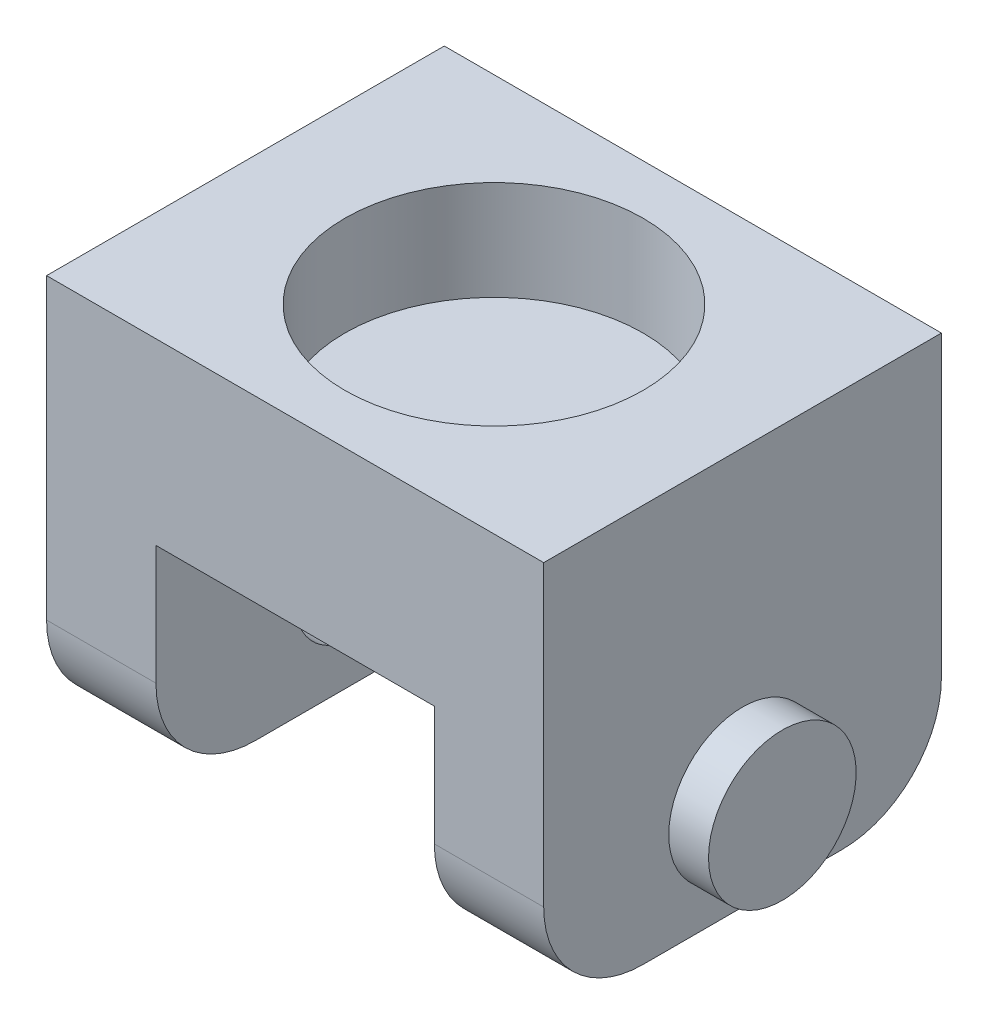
ISO-10303-21;
HEADER;
FILE_DESCRIPTION(('STEP AP214'),'2;1');
FILE_NAME('part.step','',(''),(''),'','','');
FILE_SCHEMA(('AUTOMOTIVE_DESIGN { 1 0 10303 214 1 1 1 1 }'));
ENDSEC;
DATA;
#1=APPLICATION_CONTEXT('core data for automotive mechanical design processes');
#2=APPLICATION_PROTOCOL_DEFINITION('international standard','automotive_design',2000,#1);
#3=PRODUCT_CONTEXT('',#1,'mechanical');
#4=PRODUCT('Part','Part','',(#3));
#5=PRODUCT_RELATED_PRODUCT_CATEGORY('part','',(#4));
#6=PRODUCT_DEFINITION_FORMATION('','',#4);
#7=PRODUCT_DEFINITION_CONTEXT('part definition',#1,'design');
#8=PRODUCT_DEFINITION('design','',#6,#7);
#9=PRODUCT_DEFINITION_SHAPE('','',#8);
#10=(LENGTH_UNIT() NAMED_UNIT(*) SI_UNIT(.MILLI.,.METRE.));
#11=(NAMED_UNIT(*) PLANE_ANGLE_UNIT() SI_UNIT($,.RADIAN.));
#12=(NAMED_UNIT(*) SI_UNIT($,.STERADIAN.) SOLID_ANGLE_UNIT());
#13=UNCERTAINTY_MEASURE_WITH_UNIT(LENGTH_MEASURE(1.E-05),#10,'distance_accuracy_value','');
#14=(GEOMETRIC_REPRESENTATION_CONTEXT(3) GLOBAL_UNCERTAINTY_ASSIGNED_CONTEXT((#13)) GLOBAL_UNIT_ASSIGNED_CONTEXT((#10,
#11,#12)) REPRESENTATION_CONTEXT('',''));
#15=CARTESIAN_POINT('',(0.,0.,0.));
#16=DIRECTION('',(0.,0.,1.));
#17=DIRECTION('',(1.,0.,0.));
#18=AXIS2_PLACEMENT_3D('',#15,#16,#17);
#19=CARTESIAN_POINT('',(0.,0.,0.));
#20=DIRECTION('',(0.,1.,0.));
#21=DIRECTION('',(0.,0.,1.));
#22=AXIS2_PLACEMENT_3D('',#19,#20,#21);
#23=PLANE('',#22);
#24=DIRECTION('',(0.,0.,-1.));
#25=VECTOR('',#24,1.);
#26=CARTESIAN_POINT('',(6.99999999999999,0.,0.));
#27=LINE('',#26,#25);
#28=CARTESIAN_POINT('',(6.99999999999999,0.,5.));
#29=VERTEX_POINT('',#28);
#30=CARTESIAN_POINT('',(6.99999999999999,0.,-5.));
#31=VERTEX_POINT('',#30);
#32=EDGE_CURVE('E198',#29,#31,#27,.T.);
#33=ORIENTED_EDGE('',*,*,#32,.T.);
#34=DIRECTION('',(-1.,0.,0.));
#35=VECTOR('',#34,1.);
#36=CARTESIAN_POINT('',(0.,0.,-5.));
#37=LINE('',#36,#35);
#38=CARTESIAN_POINT('',(12.5,0.,-5.));
#39=VERTEX_POINT('',#38);
#40=EDGE_CURVE('E215',#31,#39,#37,.F.);
#41=ORIENTED_EDGE('',*,*,#40,.T.);
#42=DIRECTION('',(0.,0.,-1.));
#43=VECTOR('',#42,1.);
#44=CARTESIAN_POINT('',(12.5,0.,-10.));
#45=LINE('',#44,#43);
#46=CARTESIAN_POINT('',(12.5,0.,5.));
#47=VERTEX_POINT('',#46);
#48=EDGE_CURVE('E168',#47,#39,#45,.T.);
#49=ORIENTED_EDGE('',*,*,#48,.F.);
#50=DIRECTION('',(1.,0.,0.));
#51=VECTOR('',#50,1.);
#52=CARTESIAN_POINT('',(0.,0.,5.));
#53=LINE('',#52,#51);
#54=EDGE_CURVE('E213',#47,#29,#53,.F.);
#55=ORIENTED_EDGE('',*,*,#54,.T.);
#56=EDGE_LOOP('',(#33,#41,#49,#55));
#57=FACE_BOUND('',#56,.T.);
#58=ADVANCED_FACE('F38',(#57),#23,.F.);
#59=CARTESIAN_POINT('',(12.5,20.,-10.));
#60=DIRECTION('',(-1.,0.,0.));
#61=DIRECTION('',(0.,0.,1.));
#62=AXIS2_PLACEMENT_3D('',#59,#60,#61);
#63=PLANE('',#62);
#64=CARTESIAN_POINT('',(12.5,5.,0.));
#65=DIRECTION('',(-1.,0.,0.));
#66=DIRECTION('',(0.,0.,1.));
#67=AXIS2_PLACEMENT_3D('',#64,#65,#66);
#68=CIRCLE('',#67,3.71229475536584);
#69=CARTESIAN_POINT('',(12.5,5.,3.71229475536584));
#70=VERTEX_POINT('',#69);
#71=EDGE_CURVE('E456',#70,#70,#68,.T.);
#72=ORIENTED_EDGE('',*,*,#71,.T.);
#73=EDGE_LOOP('',(#72));
#74=FACE_BOUND('',#73,.T.);
#75=ORIENTED_EDGE('',*,*,#48,.T.);
#76=CARTESIAN_POINT('',(12.5,5.,-5.));
#77=DIRECTION('',(-1.,0.,0.));
#78=DIRECTION('',(0.,0.,1.));
#79=AXIS2_PLACEMENT_3D('',#76,#77,#78);
#80=CIRCLE('',#79,5.);
#81=CARTESIAN_POINT('',(12.5,5.,-10.));
#82=VERTEX_POINT('',#81);
#83=EDGE_CURVE('E219',#39,#82,#80,.F.);
#84=ORIENTED_EDGE('',*,*,#83,.T.);
#85=DIRECTION('',(0.,-1.,0.));
#86=VECTOR('',#85,1.);
#87=CARTESIAN_POINT('',(12.5,20.,-10.));
#88=LINE('',#87,#86);
#89=CARTESIAN_POINT('',(12.5,20.,-10.));
#90=VERTEX_POINT('',#89);
#91=EDGE_CURVE('E194',#90,#82,#88,.T.);
#92=ORIENTED_EDGE('',*,*,#91,.F.);
#93=DIRECTION('',(0.,0.,-1.));
#94=VECTOR('',#93,1.);
#95=CARTESIAN_POINT('',(12.5,20.,-10.));
#96=LINE('',#95,#94);
#97=CARTESIAN_POINT('',(12.5,20.,10.));
#98=VERTEX_POINT('',#97);
#99=EDGE_CURVE('E171',#98,#90,#96,.T.);
#100=ORIENTED_EDGE('',*,*,#99,.F.);
#101=DIRECTION('',(0.,-1.,0.));
#102=VECTOR('',#101,1.);
#103=CARTESIAN_POINT('',(12.5,20.,10.));
#104=LINE('',#103,#102);
#105=CARTESIAN_POINT('',(12.5,5.,10.));
#106=VERTEX_POINT('',#105);
#107=EDGE_CURVE('E181',#98,#106,#104,.T.);
#108=ORIENTED_EDGE('',*,*,#107,.T.);
#109=CARTESIAN_POINT('',(12.5,5.,5.));
#110=DIRECTION('',(-1.,0.,0.));
#111=DIRECTION('',(0.,0.,1.));
#112=AXIS2_PLACEMENT_3D('',#109,#110,#111);
#113=CIRCLE('',#112,5.);
#114=EDGE_CURVE('E217',#106,#47,#113,.F.);
#115=ORIENTED_EDGE('',*,*,#114,.T.);
#116=EDGE_LOOP('',(#75,#84,#92,#100,#108,#115));
#117=FACE_BOUND('',#116,.T.);
#118=ADVANCED_FACE('F271',(#74,#117),#63,.F.);
#119=CARTESIAN_POINT('',(-12.5,20.,-10.));
#120=DIRECTION('',(0.,0.,1.));
#121=DIRECTION('',(1.,0.,0.));
#122=AXIS2_PLACEMENT_3D('',#119,#120,#121);
#123=PLANE('',#122);
#124=ORIENTED_EDGE('',*,*,#91,.T.);
#125=DIRECTION('',(-1.,0.,0.));
#126=VECTOR('',#125,1.);
#127=CARTESIAN_POINT('',(-12.5,5.,-10.));
#128=LINE('',#127,#126);
#129=CARTESIAN_POINT('',(6.99999999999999,5.,-10.));
#130=VERTEX_POINT('',#129);
#131=EDGE_CURVE('E137',#82,#130,#128,.T.);
#132=ORIENTED_EDGE('',*,*,#131,.T.);
#133=DIRECTION('',(0.,1.,0.));
#134=VECTOR('',#133,1.);
#135=CARTESIAN_POINT('',(6.99999999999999,11.,-10.));
#136=LINE('',#135,#134);
#137=CARTESIAN_POINT('',(6.99999999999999,11.,-10.));
#138=VERTEX_POINT('',#137);
#139=EDGE_CURVE('E129',#130,#138,#136,.T.);
#140=ORIENTED_EDGE('',*,*,#139,.T.);
#141=DIRECTION('',(-1.,0.,0.));
#142=VECTOR('',#141,1.);
#143=CARTESIAN_POINT('',(-7.00000000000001,11.,-10.));
#144=LINE('',#143,#142);
#145=CARTESIAN_POINT('',(-7.00000000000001,11.,-10.));
#146=VERTEX_POINT('',#145);
#147=EDGE_CURVE('E135',#138,#146,#144,.T.);
#148=ORIENTED_EDGE('',*,*,#147,.T.);
#149=DIRECTION('',(0.,-1.,0.));
#150=VECTOR('',#149,1.);
#151=CARTESIAN_POINT('',(-7.00000000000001,11.,-10.));
#152=LINE('',#151,#150);
#153=CARTESIAN_POINT('',(-7.00000000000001,5.,-10.));
#154=VERTEX_POINT('',#153);
#155=EDGE_CURVE('E150',#146,#154,#152,.T.);
#156=ORIENTED_EDGE('',*,*,#155,.T.);
#157=DIRECTION('',(-1.,0.,0.));
#158=VECTOR('',#157,1.);
#159=CARTESIAN_POINT('',(-12.5,5.,-10.));
#160=LINE('',#159,#158);
#161=CARTESIAN_POINT('',(-12.5,5.,-10.));
#162=VERTEX_POINT('',#161);
#163=EDGE_CURVE('E201',#154,#162,#160,.T.);
#164=ORIENTED_EDGE('',*,*,#163,.T.);
#165=DIRECTION('',(0.,-1.,0.));
#166=VECTOR('',#165,1.);
#167=CARTESIAN_POINT('',(-12.5,20.,-10.));
#168=LINE('',#167,#166);
#169=CARTESIAN_POINT('',(-12.5,20.,-10.));
#170=VERTEX_POINT('',#169);
#171=EDGE_CURVE('E191',#170,#162,#168,.T.);
#172=ORIENTED_EDGE('',*,*,#171,.F.);
#173=DIRECTION('',(-1.,0.,0.));
#174=VECTOR('',#173,1.);
#175=CARTESIAN_POINT('',(-12.5,20.,-10.));
#176=LINE('',#175,#174);
#177=EDGE_CURVE('E174',#90,#170,#176,.T.);
#178=ORIENTED_EDGE('',*,*,#177,.F.);
#179=EDGE_LOOP('',(#124,#132,#140,#148,#156,#164,#172,#178));
#180=FACE_BOUND('',#179,.T.);
#181=ADVANCED_FACE('F132',(#180),#123,.F.);
#182=CARTESIAN_POINT('',(-12.5,20.,-10.));
#183=DIRECTION('',(1.,0.,0.));
#184=DIRECTION('',(0.,0.,-1.));
#185=AXIS2_PLACEMENT_3D('',#182,#183,#184);
#186=PLANE('',#185);
#187=CARTESIAN_POINT('',(-12.5,5.,0.));
#188=DIRECTION('',(1.,0.,0.));
#189=DIRECTION('',(0.,0.,-1.));
#190=AXIS2_PLACEMENT_3D('',#187,#188,#189);
#191=CIRCLE('',#190,3.71229475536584);
#192=CARTESIAN_POINT('',(-12.5,5.,-3.71229475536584));
#193=VERTEX_POINT('',#192);
#194=EDGE_CURVE('E11',#193,#193,#191,.F.);
#195=ORIENTED_EDGE('',*,*,#194,.F.);
#196=EDGE_LOOP('',(#195));
#197=FACE_BOUND('',#196,.T.);
#198=ORIENTED_EDGE('',*,*,#171,.T.);
#199=CARTESIAN_POINT('',(-12.5,5.,-5.));
#200=DIRECTION('',(1.,0.,0.));
#201=DIRECTION('',(0.,0.,-1.));
#202=AXIS2_PLACEMENT_3D('',#199,#200,#201);
#203=CIRCLE('',#202,5.);
#204=CARTESIAN_POINT('',(-12.5,0.,-5.));
#205=VERTEX_POINT('',#204);
#206=EDGE_CURVE('E229',#162,#205,#203,.F.);
#207=ORIENTED_EDGE('',*,*,#206,.T.);
#208=DIRECTION('',(0.,0.,1.));
#209=VECTOR('',#208,1.);
#210=CARTESIAN_POINT('',(-12.5,0.,-10.));
#211=LINE('',#210,#209);
#212=CARTESIAN_POINT('',(-12.5,0.,5.));
#213=VERTEX_POINT('',#212);
#214=EDGE_CURVE('E175',#205,#213,#211,.T.);
#215=ORIENTED_EDGE('',*,*,#214,.T.);
#216=CARTESIAN_POINT('',(-12.5,5.,5.));
#217=DIRECTION('',(1.,0.,0.));
#218=DIRECTION('',(0.,0.,-1.));
#219=AXIS2_PLACEMENT_3D('',#216,#217,#218);
#220=CIRCLE('',#219,5.);
#221=CARTESIAN_POINT('',(-12.5,5.,10.));
#222=VERTEX_POINT('',#221);
#223=EDGE_CURVE('E227',#213,#222,#220,.F.);
#224=ORIENTED_EDGE('',*,*,#223,.T.);
#225=DIRECTION('',(0.,-1.,0.));
#226=VECTOR('',#225,1.);
#227=CARTESIAN_POINT('',(-12.5,20.,10.));
#228=LINE('',#227,#226);
#229=CARTESIAN_POINT('',(-12.5,20.,10.));
#230=VERTEX_POINT('',#229);
#231=EDGE_CURVE('E188',#230,#222,#228,.T.);
#232=ORIENTED_EDGE('',*,*,#231,.F.);
#233=DIRECTION('',(0.,0.,1.));
#234=VECTOR('',#233,1.);
#235=CARTESIAN_POINT('',(-12.5,20.,-10.));
#236=LINE('',#235,#234);
#237=EDGE_CURVE('E177',#170,#230,#236,.T.);
#238=ORIENTED_EDGE('',*,*,#237,.F.);
#239=EDGE_LOOP('',(#198,#207,#215,#224,#232,#238));
#240=FACE_BOUND('',#239,.T.);
#241=ADVANCED_FACE('F241',(#197,#240),#186,.F.);
#242=CARTESIAN_POINT('',(-12.5,20.,10.));
#243=DIRECTION('',(0.,0.,-1.));
#244=DIRECTION('',(-1.,0.,0.));
#245=AXIS2_PLACEMENT_3D('',#242,#243,#244);
#246=PLANE('',#245);
#247=DIRECTION('',(0.,1.,0.));
#248=VECTOR('',#247,1.);
#249=CARTESIAN_POINT('',(6.99999999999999,11.,10.));
#250=LINE('',#249,#248);
#251=CARTESIAN_POINT('',(6.99999999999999,5.,10.));
#252=VERTEX_POINT('',#251);
#253=CARTESIAN_POINT('',(6.99999999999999,11.,10.));
#254=VERTEX_POINT('',#253);
#255=EDGE_CURVE('E145',#252,#254,#250,.T.);
#256=ORIENTED_EDGE('',*,*,#255,.F.);
#257=DIRECTION('',(1.,0.,0.));
#258=VECTOR('',#257,1.);
#259=CARTESIAN_POINT('',(-12.5,5.,10.));
#260=LINE('',#259,#258);
#261=EDGE_CURVE('E224',#252,#106,#260,.T.);
#262=ORIENTED_EDGE('',*,*,#261,.T.);
#263=ORIENTED_EDGE('',*,*,#107,.F.);
#264=DIRECTION('',(1.,0.,0.));
#265=VECTOR('',#264,1.);
#266=CARTESIAN_POINT('',(-12.5,20.,10.));
#267=LINE('',#266,#265);
#268=EDGE_CURVE('E179',#230,#98,#267,.T.);
#269=ORIENTED_EDGE('',*,*,#268,.F.);
#270=ORIENTED_EDGE('',*,*,#231,.T.);
#271=DIRECTION('',(1.,0.,0.));
#272=VECTOR('',#271,1.);
#273=CARTESIAN_POINT('',(-12.5,5.,10.));
#274=LINE('',#273,#272);
#275=CARTESIAN_POINT('',(-7.00000000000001,5.,10.));
#276=VERTEX_POINT('',#275);
#277=EDGE_CURVE('E221',#222,#276,#274,.T.);
#278=ORIENTED_EDGE('',*,*,#277,.T.);
#279=DIRECTION('',(0.,-1.,0.));
#280=VECTOR('',#279,1.);
#281=CARTESIAN_POINT('',(-7.00000000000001,11.,10.));
#282=LINE('',#281,#280);
#283=CARTESIAN_POINT('',(-7.00000000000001,11.,10.));
#284=VERTEX_POINT('',#283);
#285=EDGE_CURVE('E139',#284,#276,#282,.T.);
#286=ORIENTED_EDGE('',*,*,#285,.F.);
#287=DIRECTION('',(-1.,0.,0.));
#288=VECTOR('',#287,1.);
#289=CARTESIAN_POINT('',(-7.00000000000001,11.,10.));
#290=LINE('',#289,#288);
#291=EDGE_CURVE('E159',#254,#284,#290,.T.);
#292=ORIENTED_EDGE('',*,*,#291,.F.);
#293=EDGE_LOOP('',(#256,#262,#263,#269,#270,#278,#286,#292));
#294=FACE_BOUND('',#293,.T.);
#295=ADVANCED_FACE('F251',(#294),#246,.F.);
#296=CARTESIAN_POINT('',(0.,20.,0.));
#297=DIRECTION('',(0.,1.,0.));
#298=DIRECTION('',(0.,0.,1.));
#299=AXIS2_PLACEMENT_3D('',#296,#297,#298);
#300=PLANE('',#299);
#301=CARTESIAN_POINT('',(0.,20.,0.));
#302=DIRECTION('',(0.,1.,0.));
#303=DIRECTION('',(0.,0.,1.));
#304=AXIS2_PLACEMENT_3D('',#301,#302,#303);
#305=CIRCLE('',#304,7.5);
#306=CARTESIAN_POINT('',(0.,20.,7.5));
#307=VERTEX_POINT('',#306);
#308=EDGE_CURVE('E163',#307,#307,#305,.T.);
#309=ORIENTED_EDGE('',*,*,#308,.F.);
#310=EDGE_LOOP('',(#309));
#311=FACE_BOUND('',#310,.T.);
#312=ORIENTED_EDGE('',*,*,#99,.T.);
#313=ORIENTED_EDGE('',*,*,#177,.T.);
#314=ORIENTED_EDGE('',*,*,#237,.T.);
#315=ORIENTED_EDGE('',*,*,#268,.T.);
#316=EDGE_LOOP('',(#312,#313,#314,#315));
#317=FACE_BOUND('',#316,.T.);
#318=ADVANCED_FACE('F256',(#311,#317),#300,.T.);
#319=ORIENTED_EDGE('',*,*,#214,.F.);
#320=DIRECTION('',(-1.,0.,0.));
#321=VECTOR('',#320,1.);
#322=CARTESIAN_POINT('',(0.,0.,-5.));
#323=LINE('',#322,#321);
#324=CARTESIAN_POINT('',(-7.00000000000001,0.,-5.));
#325=VERTEX_POINT('',#324);
#326=EDGE_CURVE('E60',#205,#325,#323,.F.);
#327=ORIENTED_EDGE('',*,*,#326,.T.);
#328=DIRECTION('',(0.,0.,1.));
#329=VECTOR('',#328,1.);
#330=CARTESIAN_POINT('',(-7.00000000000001,0.,0.));
#331=LINE('',#330,#329);
#332=CARTESIAN_POINT('',(-7.00000000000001,0.,5.));
#333=VERTEX_POINT('',#332);
#334=EDGE_CURVE('E196',#325,#333,#331,.T.);
#335=ORIENTED_EDGE('',*,*,#334,.T.);
#336=DIRECTION('',(1.,0.,0.));
#337=VECTOR('',#336,1.);
#338=CARTESIAN_POINT('',(0.,0.,5.));
#339=LINE('',#338,#337);
#340=EDGE_CURVE('E231',#333,#213,#339,.F.);
#341=ORIENTED_EDGE('',*,*,#340,.T.);
#342=EDGE_LOOP('',(#319,#327,#335,#341));
#343=FACE_BOUND('',#342,.T.);
#344=ADVANCED_FACE('F244',(#343),#23,.F.);
#345=CARTESIAN_POINT('',(0.,15.,0.));
#346=DIRECTION('',(0.,1.,0.));
#347=DIRECTION('',(0.,0.,1.));
#348=AXIS2_PLACEMENT_3D('',#345,#346,#347);
#349=CYLINDRICAL_SURFACE('',#348,7.5);
#350=CARTESIAN_POINT('',(0.,15.,0.));
#351=DIRECTION('',(0.,1.,0.));
#352=DIRECTION('',(0.,0.,1.));
#353=AXIS2_PLACEMENT_3D('',#350,#351,#352);
#354=CIRCLE('',#353,7.5);
#355=CARTESIAN_POINT('',(0.,15.,7.5));
#356=VERTEX_POINT('',#355);
#357=EDGE_CURVE('E165',#356,#356,#354,.T.);
#358=ORIENTED_EDGE('',*,*,#357,.F.);
#359=EDGE_LOOP('',(#358));
#360=FACE_BOUND('',#359,.T.);
#361=ORIENTED_EDGE('',*,*,#308,.T.);
#362=EDGE_LOOP('',(#361));
#363=FACE_BOUND('',#362,.T.);
#364=ADVANCED_FACE('F324',(#360,#363),#349,.F.);
#365=CARTESIAN_POINT('',(0.,15.,0.));
#366=DIRECTION('',(0.,1.,0.));
#367=DIRECTION('',(0.,0.,1.));
#368=AXIS2_PLACEMENT_3D('',#365,#366,#367);
#369=PLANE('',#368);
#370=ORIENTED_EDGE('',*,*,#357,.T.);
#371=EDGE_LOOP('',(#370));
#372=FACE_BOUND('',#371,.T.);
#373=ADVANCED_FACE('F320',(#372),#369,.T.);
#374=CARTESIAN_POINT('',(6.99999999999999,11.,-10.));
#375=DIRECTION('',(1.,0.,0.));
#376=DIRECTION('',(0.,1.,0.));
#377=AXIS2_PLACEMENT_3D('',#374,#375,#376);
#378=PLANE('',#377);
#379=CARTESIAN_POINT('',(6.99999999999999,5.,0.));
#380=DIRECTION('',(1.,0.,0.));
#381=DIRECTION('',(0.,1.,0.));
#382=AXIS2_PLACEMENT_3D('',#379,#380,#381);
#383=CIRCLE('',#382,3.);
#384=CARTESIAN_POINT('',(6.99999999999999,8.,0.));
#385=VERTEX_POINT('',#384);
#386=EDGE_CURVE('E160',#385,#385,#383,.T.);
#387=ORIENTED_EDGE('',*,*,#386,.T.);
#388=EDGE_LOOP('',(#387));
#389=FACE_BOUND('',#388,.T.);
#390=ORIENTED_EDGE('',*,*,#139,.F.);
#391=CARTESIAN_POINT('',(6.99999999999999,5.,-5.));
#392=DIRECTION('',(1.,0.,0.));
#393=DIRECTION('',(0.,1.,0.));
#394=AXIS2_PLACEMENT_3D('',#391,#392,#393);
#395=CIRCLE('',#394,5.);
#396=EDGE_CURVE('E211',#130,#31,#395,.F.);
#397=ORIENTED_EDGE('',*,*,#396,.T.);
#398=ORIENTED_EDGE('',*,*,#32,.F.);
#399=CARTESIAN_POINT('',(6.99999999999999,5.,5.));
#400=DIRECTION('',(1.,0.,0.));
#401=DIRECTION('',(0.,1.,0.));
#402=AXIS2_PLACEMENT_3D('',#399,#400,#401);
#403=CIRCLE('',#402,5.);
#404=EDGE_CURVE('E209',#29,#252,#403,.F.);
#405=ORIENTED_EDGE('',*,*,#404,.T.);
#406=ORIENTED_EDGE('',*,*,#255,.T.);
#407=DIRECTION('',(0.,0.,1.));
#408=VECTOR('',#407,1.);
#409=CARTESIAN_POINT('',(6.99999999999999,11.,-10.));
#410=LINE('',#409,#408);
#411=EDGE_CURVE('E142',#138,#254,#410,.T.);
#412=ORIENTED_EDGE('',*,*,#411,.F.);
#413=EDGE_LOOP('',(#390,#397,#398,#405,#406,#412));
#414=FACE_BOUND('',#413,.T.);
#415=ADVANCED_FACE('F143',(#389,#414),#378,.F.);
#416=CARTESIAN_POINT('',(-7.00000000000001,11.,-10.));
#417=DIRECTION('',(-1.,0.,0.));
#418=DIRECTION('',(0.,-1.,0.));
#419=AXIS2_PLACEMENT_3D('',#416,#417,#418);
#420=PLANE('',#419);
#421=CARTESIAN_POINT('',(-7.00000000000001,5.,0.));
#422=DIRECTION('',(-1.,0.,0.));
#423=DIRECTION('',(0.,-1.,0.));
#424=AXIS2_PLACEMENT_3D('',#421,#422,#423);
#425=CIRCLE('',#424,3.);
#426=CARTESIAN_POINT('',(-7.00000000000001,2.,0.));
#427=VERTEX_POINT('',#426);
#428=EDGE_CURVE('E202',#427,#427,#425,.T.);
#429=ORIENTED_EDGE('',*,*,#428,.T.);
#430=EDGE_LOOP('',(#429));
#431=FACE_BOUND('',#430,.T.);
#432=ORIENTED_EDGE('',*,*,#334,.F.);
#433=CARTESIAN_POINT('',(-7.00000000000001,5.,-5.));
#434=DIRECTION('',(-1.,0.,0.));
#435=DIRECTION('',(0.,-1.,0.));
#436=AXIS2_PLACEMENT_3D('',#433,#434,#435);
#437=CIRCLE('',#436,5.);
#438=EDGE_CURVE('E46',#325,#154,#437,.F.);
#439=ORIENTED_EDGE('',*,*,#438,.T.);
#440=ORIENTED_EDGE('',*,*,#155,.F.);
#441=DIRECTION('',(0.,0.,1.));
#442=VECTOR('',#441,1.);
#443=CARTESIAN_POINT('',(-7.00000000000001,11.,-10.));
#444=LINE('',#443,#442);
#445=EDGE_CURVE('E149',#146,#284,#444,.T.);
#446=ORIENTED_EDGE('',*,*,#445,.T.);
#447=ORIENTED_EDGE('',*,*,#285,.T.);
#448=CARTESIAN_POINT('',(-7.00000000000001,5.,5.));
#449=DIRECTION('',(-1.,0.,0.));
#450=DIRECTION('',(0.,-1.,0.));
#451=AXIS2_PLACEMENT_3D('',#448,#449,#450);
#452=CIRCLE('',#451,5.);
#453=EDGE_CURVE('E53',#276,#333,#452,.F.);
#454=ORIENTED_EDGE('',*,*,#453,.T.);
#455=EDGE_LOOP('',(#432,#439,#440,#446,#447,#454));
#456=FACE_BOUND('',#455,.T.);
#457=ADVANCED_FACE('F235',(#431,#456),#420,.F.);
#458=CARTESIAN_POINT('',(-7.00000000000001,11.,-10.));
#459=DIRECTION('',(0.,1.,0.));
#460=DIRECTION('',(0.,0.,1.));
#461=AXIS2_PLACEMENT_3D('',#458,#459,#460);
#462=PLANE('',#461);
#463=ORIENTED_EDGE('',*,*,#291,.T.);
#464=ORIENTED_EDGE('',*,*,#445,.F.);
#465=ORIENTED_EDGE('',*,*,#147,.F.);
#466=ORIENTED_EDGE('',*,*,#411,.T.);
#467=EDGE_LOOP('',(#463,#464,#465,#466));
#468=FACE_BOUND('',#467,.T.);
#469=ADVANCED_FACE('F152',(#468),#462,.F.);
#470=CARTESIAN_POINT('',(12.5,5.,0.));
#471=DIRECTION('',(-1.,0.,0.));
#472=DIRECTION('',(0.,0.,1.));
#473=AXIS2_PLACEMENT_3D('',#470,#471,#472);
#474=CYLINDRICAL_SURFACE('',#473,3.);
#475=CARTESIAN_POINT('',(-12.5,5.,0.));
#476=DIRECTION('',(-1.,0.,0.));
#477=DIRECTION('',(0.,0.,1.));
#478=AXIS2_PLACEMENT_3D('',#475,#476,#477);
#479=CIRCLE('',#478,3.);
#480=CARTESIAN_POINT('',(-12.5,5.,3.));
#481=VERTEX_POINT('',#480);
#482=EDGE_CURVE('E459',#481,#481,#479,.F.);
#483=ORIENTED_EDGE('',*,*,#482,.F.);
#484=EDGE_LOOP('',(#483));
#485=FACE_BOUND('',#484,.T.);
#486=ORIENTED_EDGE('',*,*,#428,.F.);
#487=EDGE_LOOP('',(#486));
#488=FACE_BOUND('',#487,.T.);
#489=ADVANCED_FACE('F311',(#485,#488),#474,.F.);
#490=CARTESIAN_POINT('',(12.5,5.,0.));
#491=DIRECTION('',(-1.,0.,0.));
#492=DIRECTION('',(0.,0.,1.));
#493=AXIS2_PLACEMENT_3D('',#490,#491,#492);
#494=CIRCLE('',#493,3.);
#495=CARTESIAN_POINT('',(12.5,5.,3.));
#496=VERTEX_POINT('',#495);
#497=EDGE_CURVE('E205',#496,#496,#494,.T.);
#498=ORIENTED_EDGE('',*,*,#497,.F.);
#499=EDGE_LOOP('',(#498));
#500=FACE_BOUND('',#499,.T.);
#501=ORIENTED_EDGE('',*,*,#386,.F.);
#502=EDGE_LOOP('',(#501));
#503=FACE_BOUND('',#502,.T.);
#504=ADVANCED_FACE('F286',(#500,#503),#474,.F.);
#505=CARTESIAN_POINT('',(-12.5,5.,-5.));
#506=DIRECTION('',(-1.,0.,0.));
#507=DIRECTION('',(0.,0.,1.));
#508=AXIS2_PLACEMENT_3D('',#505,#506,#507);
#509=CYLINDRICAL_SURFACE('',#508,5.);
#510=ORIENTED_EDGE('',*,*,#83,.F.);
#511=ORIENTED_EDGE('',*,*,#40,.F.);
#512=ORIENTED_EDGE('',*,*,#396,.F.);
#513=ORIENTED_EDGE('',*,*,#131,.F.);
#514=EDGE_LOOP('',(#510,#511,#512,#513));
#515=FACE_BOUND('',#514,.T.);
#516=ADVANCED_FACE('F261',(#515),#509,.T.);
#517=CARTESIAN_POINT('',(-12.5,5.,5.));
#518=DIRECTION('',(1.,0.,0.));
#519=DIRECTION('',(0.,0.,-1.));
#520=AXIS2_PLACEMENT_3D('',#517,#518,#519);
#521=CYLINDRICAL_SURFACE('',#520,5.);
#522=ORIENTED_EDGE('',*,*,#404,.F.);
#523=ORIENTED_EDGE('',*,*,#54,.F.);
#524=ORIENTED_EDGE('',*,*,#114,.F.);
#525=ORIENTED_EDGE('',*,*,#261,.F.);
#526=EDGE_LOOP('',(#522,#523,#524,#525));
#527=FACE_BOUND('',#526,.T.);
#528=ADVANCED_FACE('F269',(#527),#521,.T.);
#529=CARTESIAN_POINT('',(-12.5,5.,-5.));
#530=DIRECTION('',(-1.,0.,0.));
#531=DIRECTION('',(0.,0.,1.));
#532=AXIS2_PLACEMENT_3D('',#529,#530,#531);
#533=CYLINDRICAL_SURFACE('',#532,5.);
#534=ORIENTED_EDGE('',*,*,#438,.F.);
#535=ORIENTED_EDGE('',*,*,#326,.F.);
#536=ORIENTED_EDGE('',*,*,#206,.F.);
#537=ORIENTED_EDGE('',*,*,#163,.F.);
#538=EDGE_LOOP('',(#534,#535,#536,#537));
#539=FACE_BOUND('',#538,.T.);
#540=ADVANCED_FACE('F239',(#539),#533,.T.);
#541=CARTESIAN_POINT('',(-12.5,5.,5.));
#542=DIRECTION('',(1.,0.,0.));
#543=DIRECTION('',(0.,0.,-1.));
#544=AXIS2_PLACEMENT_3D('',#541,#542,#543);
#545=CYLINDRICAL_SURFACE('',#544,5.);
#546=ORIENTED_EDGE('',*,*,#223,.F.);
#547=ORIENTED_EDGE('',*,*,#340,.F.);
#548=ORIENTED_EDGE('',*,*,#453,.F.);
#549=ORIENTED_EDGE('',*,*,#277,.F.);
#550=EDGE_LOOP('',(#546,#547,#548,#549));
#551=FACE_BOUND('',#550,.T.);
#552=ADVANCED_FACE('F40',(#551),#545,.T.);
#553=CARTESIAN_POINT('',(-12.5,5.,0.));
#554=DIRECTION('',(-1.,0.,0.));
#555=DIRECTION('',(0.,0.,1.));
#556=AXIS2_PLACEMENT_3D('',#553,#554,#555);
#557=PLANE('',#556);
#558=ORIENTED_EDGE('',*,*,#482,.T.);
#559=EDGE_LOOP('',(#558));
#560=FACE_BOUND('',#559,.T.);
#561=ADVANCED_FACE('F292',(#560),#557,.F.);
#562=CARTESIAN_POINT('',(-14.5,5.,0.));
#563=DIRECTION('',(1.,0.,0.));
#564=DIRECTION('',(0.,0.,-1.));
#565=AXIS2_PLACEMENT_3D('',#562,#563,#564);
#566=CYLINDRICAL_SURFACE('',#565,3.71229475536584);
#567=CARTESIAN_POINT('',(-14.5,5.,0.));
#568=DIRECTION('',(-1.,0.,0.));
#569=DIRECTION('',(0.,0.,1.));
#570=AXIS2_PLACEMENT_3D('',#567,#568,#569);
#571=CIRCLE('',#570,3.71229475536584);
#572=CARTESIAN_POINT('',(-14.5,5.,3.71229475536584));
#573=VERTEX_POINT('',#572);
#574=EDGE_CURVE('E455',#573,#573,#571,.T.);
#575=ORIENTED_EDGE('',*,*,#574,.F.);
#576=EDGE_LOOP('',(#575));
#577=FACE_BOUND('',#576,.T.);
#578=ORIENTED_EDGE('',*,*,#194,.T.);
#579=EDGE_LOOP('',(#578));
#580=FACE_BOUND('',#579,.T.);
#581=ADVANCED_FACE('F296',(#577,#580),#566,.T.);
#582=CARTESIAN_POINT('',(-14.5,5.,0.));
#583=DIRECTION('',(-1.,0.,0.));
#584=DIRECTION('',(0.,0.,1.));
#585=AXIS2_PLACEMENT_3D('',#582,#583,#584);
#586=PLANE('',#585);
#587=ORIENTED_EDGE('',*,*,#574,.T.);
#588=EDGE_LOOP('',(#587));
#589=FACE_BOUND('',#588,.T.);
#590=ADVANCED_FACE('F302',(#589),#586,.T.);
#591=CARTESIAN_POINT('',(12.5,5.,0.));
#592=DIRECTION('',(1.,0.,0.));
#593=DIRECTION('',(0.,0.,1.));
#594=AXIS2_PLACEMENT_3D('',#591,#592,#593);
#595=PLANE('',#594);
#596=ORIENTED_EDGE('',*,*,#497,.T.);
#597=EDGE_LOOP('',(#596));
#598=FACE_BOUND('',#597,.T.);
#599=ADVANCED_FACE('F420',(#598),#595,.F.);
#600=CARTESIAN_POINT('',(14.5,5.,0.));
#601=DIRECTION('',(-1.,0.,0.));
#602=DIRECTION('',(0.,0.,1.));
#603=AXIS2_PLACEMENT_3D('',#600,#601,#602);
#604=CYLINDRICAL_SURFACE('',#603,3.71229475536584);
#605=CARTESIAN_POINT('',(14.5,5.,0.));
#606=DIRECTION('',(-1.,0.,0.));
#607=DIRECTION('',(0.,0.,1.));
#608=AXIS2_PLACEMENT_3D('',#605,#606,#607);
#609=CIRCLE('',#608,3.71229475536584);
#610=CARTESIAN_POINT('',(14.5,5.,3.71229475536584));
#611=VERTEX_POINT('',#610);
#612=EDGE_CURVE('E454',#611,#611,#609,.T.);
#613=ORIENTED_EDGE('',*,*,#612,.T.);
#614=EDGE_LOOP('',(#613));
#615=FACE_BOUND('',#614,.T.);
#616=ORIENTED_EDGE('',*,*,#71,.F.);
#617=EDGE_LOOP('',(#616));
#618=FACE_BOUND('',#617,.T.);
#619=ADVANCED_FACE('F428',(#615,#618),#604,.T.);
#620=CARTESIAN_POINT('',(14.5,5.,0.));
#621=DIRECTION('',(1.,0.,0.));
#622=DIRECTION('',(0.,0.,1.));
#623=AXIS2_PLACEMENT_3D('',#620,#621,#622);
#624=PLANE('',#623);
#625=ORIENTED_EDGE('',*,*,#612,.F.);
#626=EDGE_LOOP('',(#625));
#627=FACE_BOUND('',#626,.T.);
#628=ADVANCED_FACE('F437',(#627),#624,.T.);
#629=CLOSED_SHELL('',(#58,#118,#181,#241,#295,#318,#344,#364,#373,#415,#457,#469,#489,#504,#516,
#528,#540,#552,#561,#581,#590,#599,#619,#628));
#630=MANIFOLD_SOLID_BREP('B2',#629);
#631=ADVANCED_BREP_SHAPE_REPRESENTATION('',(#18,#630),#14);
#632=SHAPE_DEFINITION_REPRESENTATION(#9,#631);
ENDSEC;
END-ISO-10303-21;
